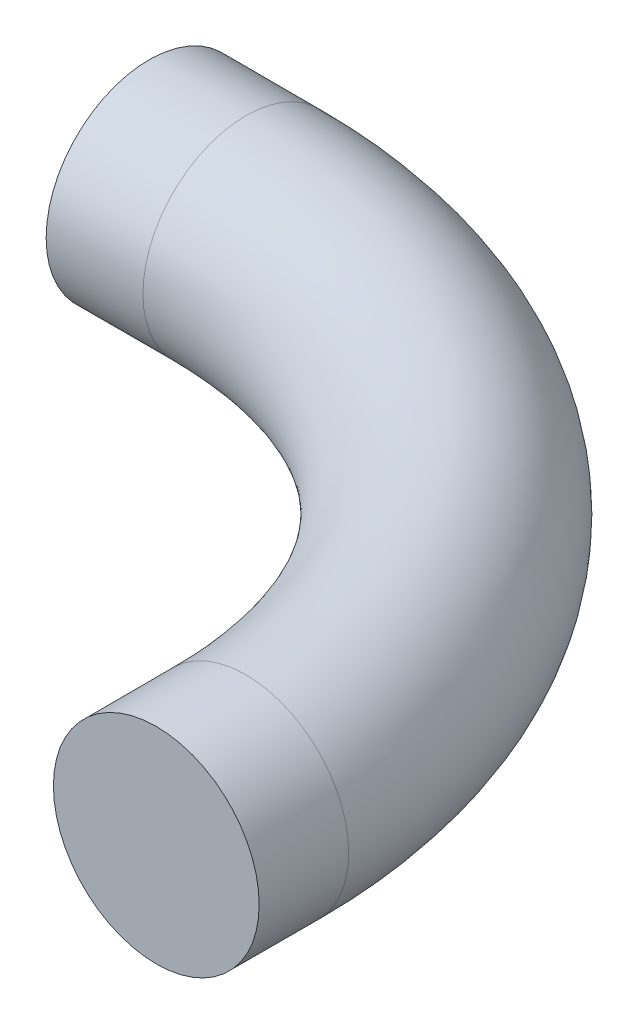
ISO-10303-21;
HEADER;
FILE_DESCRIPTION(('STEP AP214'),'2;1');
FILE_NAME('part.step','',(''),(''),'','','');
FILE_SCHEMA(('AUTOMOTIVE_DESIGN { 1 0 10303 214 1 1 1 1 }'));
ENDSEC;
DATA;
#1=APPLICATION_CONTEXT('core data for automotive mechanical design processes');
#2=APPLICATION_PROTOCOL_DEFINITION('international standard','automotive_design',2000,#1);
#3=PRODUCT_CONTEXT('',#1,'mechanical');
#4=PRODUCT('Part','Part','',(#3));
#5=PRODUCT_RELATED_PRODUCT_CATEGORY('part','',(#4));
#6=PRODUCT_DEFINITION_FORMATION('','',#4);
#7=PRODUCT_DEFINITION_CONTEXT('part definition',#1,'design');
#8=PRODUCT_DEFINITION('design','',#6,#7);
#9=PRODUCT_DEFINITION_SHAPE('','',#8);
#10=(LENGTH_UNIT() NAMED_UNIT(*) SI_UNIT(.MILLI.,.METRE.));
#11=(NAMED_UNIT(*) PLANE_ANGLE_UNIT() SI_UNIT($,.RADIAN.));
#12=(NAMED_UNIT(*) SI_UNIT($,.STERADIAN.) SOLID_ANGLE_UNIT());
#13=UNCERTAINTY_MEASURE_WITH_UNIT(LENGTH_MEASURE(1.E-05),#10,'distance_accuracy_value','');
#14=(GEOMETRIC_REPRESENTATION_CONTEXT(3) GLOBAL_UNCERTAINTY_ASSIGNED_CONTEXT((#13)) GLOBAL_UNIT_ASSIGNED_CONTEXT((#10,
#11,#12)) REPRESENTATION_CONTEXT('',''));
#15=CARTESIAN_POINT('',(0.,0.,0.));
#16=DIRECTION('',(0.,0.,1.));
#17=DIRECTION('',(1.,0.,0.));
#18=AXIS2_PLACEMENT_3D('',#15,#16,#17);
#19=CARTESIAN_POINT('',(0.,0.,200.));
#20=DIRECTION('',(0.,0.,1.));
#21=DIRECTION('',(1.,0.,0.));
#22=AXIS2_PLACEMENT_3D('',#19,#20,#21);
#23=CYLINDRICAL_SURFACE('',#22,42.5);
#24=CARTESIAN_POINT('',(0.,0.,200.));
#25=DIRECTION('',(0.,0.,-1.));
#26=DIRECTION('',(-1.,0.,0.));
#27=AXIS2_PLACEMENT_3D('',#24,#25,#26);
#28=CIRCLE('',#27,42.5);
#29=CARTESIAN_POINT('',(42.5,0.,200.));
#30=VERTEX_POINT('',#29);
#31=EDGE_CURVE('E19',#30,#30,#28,.T.);
#32=ORIENTED_EDGE('',*,*,#31,.F.);
#33=EDGE_LOOP('',(#32));
#34=FACE_BOUND('',#33,.T.);
#35=CARTESIAN_POINT('',(0.,0.,237.));
#36=DIRECTION('',(0.,0.,-1.));
#37=DIRECTION('',(-1.,0.,0.));
#38=AXIS2_PLACEMENT_3D('',#35,#36,#37);
#39=CIRCLE('',#38,42.5);
#40=CARTESIAN_POINT('',(-42.5,0.,237.));
#41=VERTEX_POINT('',#40);
#42=EDGE_CURVE('E9',#41,#41,#39,.T.);
#43=ORIENTED_EDGE('',*,*,#42,.T.);
#44=EDGE_LOOP('',(#43));
#45=FACE_BOUND('',#44,.T.);
#46=ADVANCED_FACE('F13',(#34,#45),#23,.T.);
#47=CARTESIAN_POINT('',(-200.,0.,200.));
#48=DIRECTION('',(0.,-1.,0.));
#49=DIRECTION('',(0.,0.,-1.));
#50=AXIS2_PLACEMENT_3D('',#47,#48,#49);
#51=TOROIDAL_SURFACE('',#50,200.,42.5);
#52=CARTESIAN_POINT('',(-200.,0.,0.));
#53=DIRECTION('',(-1.,0.,0.));
#54=DIRECTION('',(0.,0.,1.));
#55=AXIS2_PLACEMENT_3D('',#52,#53,#54);
#56=CIRCLE('',#55,42.5);
#57=CARTESIAN_POINT('',(-200.,0.,-42.5));
#58=VERTEX_POINT('',#57);
#59=EDGE_CURVE('E23',#58,#58,#56,.T.);
#60=CARTESIAN_POINT('',(-200.,0.,200.));
#61=DIRECTION('',(0.,-1.,0.));
#62=DIRECTION('',(0.,0.,-1.));
#63=AXIS2_PLACEMENT_3D('',#60,#61,#62);
#64=CIRCLE('',#63,242.5);
#65=EDGE_CURVE('',#58,#30,#64,.T.);
#66=ORIENTED_EDGE('',*,*,#59,.F.);
#67=ORIENTED_EDGE('',*,*,#31,.T.);
#68=ORIENTED_EDGE('',*,*,#65,.T.);
#69=ORIENTED_EDGE('',*,*,#65,.F.);
#70=EDGE_LOOP('',(#66,#68,#67,#69));
#71=FACE_BOUND('',#70,.T.);
#72=ADVANCED_FACE('F38',(#71),#51,.T.);
#73=CARTESIAN_POINT('',(-200.,0.,0.));
#74=DIRECTION('',(-1.,0.,0.));
#75=DIRECTION('',(0.,0.,1.));
#76=AXIS2_PLACEMENT_3D('',#73,#74,#75);
#77=CYLINDRICAL_SURFACE('',#76,42.5);
#78=ORIENTED_EDGE('',*,*,#59,.T.);
#79=EDGE_LOOP('',(#78));
#80=FACE_BOUND('',#79,.T.);
#81=CARTESIAN_POINT('',(-240.,0.,0.));
#82=DIRECTION('',(-1.,0.,0.));
#83=DIRECTION('',(0.,0.,1.));
#84=AXIS2_PLACEMENT_3D('',#81,#82,#83);
#85=CIRCLE('',#84,42.5);
#86=CARTESIAN_POINT('',(-240.,0.,42.5));
#87=VERTEX_POINT('',#86);
#88=EDGE_CURVE('E27',#87,#87,#85,.T.);
#89=ORIENTED_EDGE('',*,*,#88,.F.);
#90=EDGE_LOOP('',(#89));
#91=FACE_BOUND('',#90,.T.);
#92=ADVANCED_FACE('F35',(#80,#91),#77,.T.);
#93=CARTESIAN_POINT('',(0.,0.,237.));
#94=DIRECTION('',(0.,0.,-1.));
#95=DIRECTION('',(-1.,0.,0.));
#96=AXIS2_PLACEMENT_3D('',#93,#94,#95);
#97=PLANE('',#96);
#98=ORIENTED_EDGE('',*,*,#42,.F.);
#99=EDGE_LOOP('',(#98));
#100=FACE_BOUND('',#99,.T.);
#101=ADVANCED_FACE('F37',(#100),#97,.F.);
#102=CARTESIAN_POINT('',(-240.,0.,0.));
#103=DIRECTION('',(-1.,0.,0.));
#104=DIRECTION('',(0.,0.,1.));
#105=AXIS2_PLACEMENT_3D('',#102,#103,#104);
#106=PLANE('',#105);
#107=ORIENTED_EDGE('',*,*,#88,.T.);
#108=EDGE_LOOP('',(#107));
#109=FACE_BOUND('',#108,.T.);
#110=ADVANCED_FACE('F33',(#109),#106,.T.);
#111=CLOSED_SHELL('',(#46,#72,#92,#101,#110));
#112=MANIFOLD_SOLID_BREP('B1',#111);
#113=ADVANCED_BREP_SHAPE_REPRESENTATION('',(#18,#112),#14);
#114=SHAPE_DEFINITION_REPRESENTATION(#9,#113);
ENDSEC;
END-ISO-10303-21;
